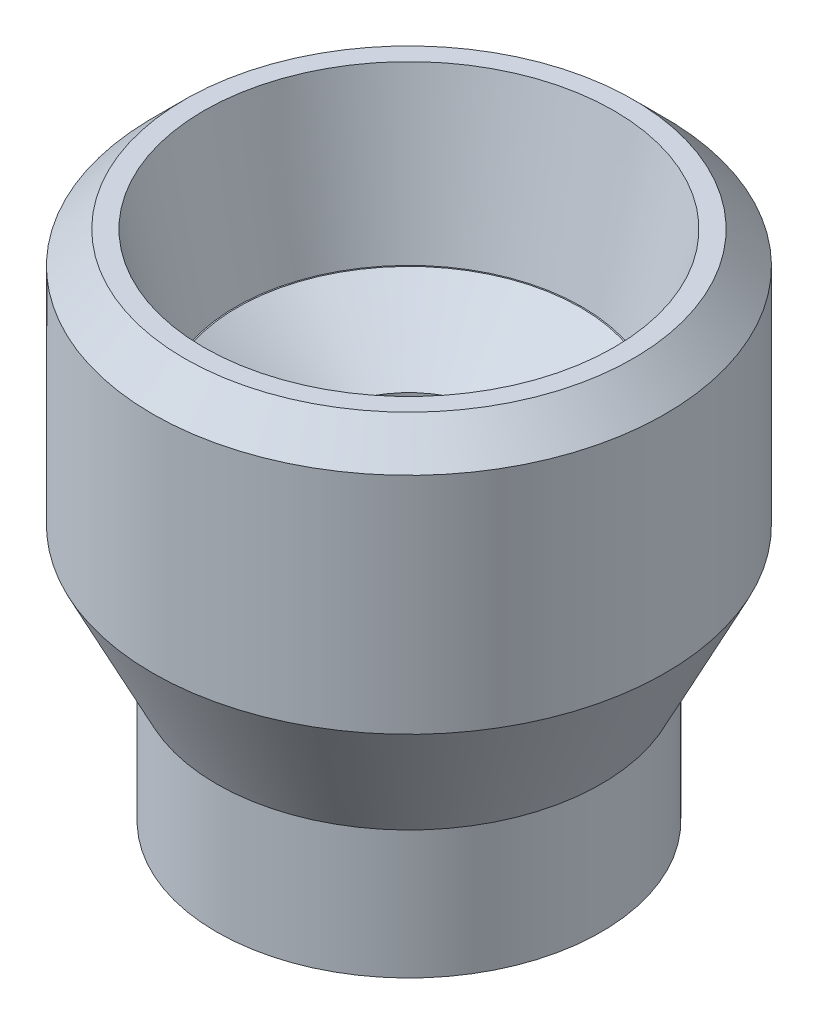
ISO-10303-21;
HEADER;
FILE_DESCRIPTION(('STEP AP214'),'2;1');
FILE_NAME('part.step','',(''),(''),'','','');
FILE_SCHEMA(('AUTOMOTIVE_DESIGN { 1 0 10303 214 1 1 1 1 }'));
ENDSEC;
DATA;
#1=APPLICATION_CONTEXT('core data for automotive mechanical design processes');
#2=APPLICATION_PROTOCOL_DEFINITION('international standard','automotive_design',2000,#1);
#3=PRODUCT_CONTEXT('',#1,'mechanical');
#4=PRODUCT('Part','Part','',(#3));
#5=PRODUCT_RELATED_PRODUCT_CATEGORY('part','',(#4));
#6=PRODUCT_DEFINITION_FORMATION('','',#4);
#7=PRODUCT_DEFINITION_CONTEXT('part definition',#1,'design');
#8=PRODUCT_DEFINITION('design','',#6,#7);
#9=PRODUCT_DEFINITION_SHAPE('','',#8);
#10=(LENGTH_UNIT() NAMED_UNIT(*) SI_UNIT(.MILLI.,.METRE.));
#11=(NAMED_UNIT(*) PLANE_ANGLE_UNIT() SI_UNIT($,.RADIAN.));
#12=(NAMED_UNIT(*) SI_UNIT($,.STERADIAN.) SOLID_ANGLE_UNIT());
#13=UNCERTAINTY_MEASURE_WITH_UNIT(LENGTH_MEASURE(1.E-05),#10,'distance_accuracy_value','');
#14=(GEOMETRIC_REPRESENTATION_CONTEXT(3) GLOBAL_UNCERTAINTY_ASSIGNED_CONTEXT((#13)) GLOBAL_UNIT_ASSIGNED_CONTEXT((#10,
#11,#12)) REPRESENTATION_CONTEXT('',''));
#15=CARTESIAN_POINT('',(0.,0.,0.));
#16=DIRECTION('',(0.,0.,1.));
#17=DIRECTION('',(1.,0.,0.));
#18=AXIS2_PLACEMENT_3D('',#15,#16,#17);
#19=CARTESIAN_POINT('',(0.,20.,0.));
#20=DIRECTION('',(0.,-1.,0.));
#21=DIRECTION('',(0.,0.,-1.));
#22=AXIS2_PLACEMENT_3D('',#19,#20,#21);
#23=CYLINDRICAL_SURFACE('',#22,3.5);
#24=CARTESIAN_POINT('',(0.,12.,0.));
#25=DIRECTION('',(0.,1.,0.));
#26=DIRECTION('',(0.,0.,1.));
#27=AXIS2_PLACEMENT_3D('',#24,#25,#26);
#28=CIRCLE('',#27,3.5);
#29=CARTESIAN_POINT('',(0.,12.,3.5));
#30=VERTEX_POINT('',#29);
#31=EDGE_CURVE('E46',#30,#30,#28,.T.);
#32=ORIENTED_EDGE('',*,*,#31,.T.);
#33=EDGE_LOOP('',(#32));
#34=FACE_BOUND('',#33,.T.);
#35=CARTESIAN_POINT('',(0.,0.,0.));
#36=DIRECTION('',(0.,-1.,0.));
#37=DIRECTION('',(0.,0.,-1.));
#38=AXIS2_PLACEMENT_3D('',#35,#36,#37);
#39=CIRCLE('',#38,3.5);
#40=CARTESIAN_POINT('',(0.,0.,-3.5));
#41=VERTEX_POINT('',#40);
#42=EDGE_CURVE('E67',#41,#41,#39,.T.);
#43=ORIENTED_EDGE('',*,*,#42,.T.);
#44=EDGE_LOOP('',(#43));
#45=FACE_BOUND('',#44,.T.);
#46=ADVANCED_FACE('F35',(#34,#45),#23,.F.);
#47=CARTESIAN_POINT('',(0.,10.,0.));
#48=DIRECTION('',(0.,-1.,0.));
#49=DIRECTION('',(0.,0.,-1.));
#50=AXIS2_PLACEMENT_3D('',#47,#48,#49);
#51=CYLINDRICAL_SURFACE('',#50,7.5);
#52=CARTESIAN_POINT('',(0.,5.00000000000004,0.));
#53=DIRECTION('',(0.,1.,0.));
#54=DIRECTION('',(0.,0.,1.));
#55=AXIS2_PLACEMENT_3D('',#52,#53,#54);
#56=CIRCLE('',#55,7.5);
#57=CARTESIAN_POINT('',(0.,5.00000000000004,7.5));
#58=VERTEX_POINT('',#57);
#59=EDGE_CURVE('E58',#58,#58,#56,.F.);
#60=ORIENTED_EDGE('',*,*,#59,.T.);
#61=EDGE_LOOP('',(#60));
#62=FACE_BOUND('',#61,.T.);
#63=CARTESIAN_POINT('',(0.,0.,0.));
#64=DIRECTION('',(0.,1.,0.));
#65=DIRECTION('',(0.,0.,1.));
#66=AXIS2_PLACEMENT_3D('',#63,#64,#65);
#67=CIRCLE('',#66,7.5);
#68=CARTESIAN_POINT('',(0.,0.,7.5));
#69=VERTEX_POINT('',#68);
#70=EDGE_CURVE('E61',#69,#69,#67,.T.);
#71=ORIENTED_EDGE('',*,*,#70,.T.);
#72=EDGE_LOOP('',(#71));
#73=FACE_BOUND('',#72,.T.);
#74=ADVANCED_FACE('F93',(#62,#73),#51,.T.);
#75=CARTESIAN_POINT('',(0.,0.,0.));
#76=DIRECTION('',(0.,1.,0.));
#77=DIRECTION('',(0.,0.,1.));
#78=AXIS2_PLACEMENT_3D('',#75,#76,#77);
#79=PLANE('',#78);
#80=ORIENTED_EDGE('',*,*,#42,.F.);
#81=EDGE_LOOP('',(#80));
#82=FACE_BOUND('',#81,.T.);
#83=ORIENTED_EDGE('',*,*,#70,.F.);
#84=EDGE_LOOP('',(#83));
#85=FACE_BOUND('',#84,.T.);
#86=ADVANCED_FACE('F89',(#82,#85),#79,.F.);
#87=CARTESIAN_POINT('',(0.,20.,0.));
#88=DIRECTION('',(0.,-1.,0.));
#89=DIRECTION('',(0.,0.,-1.));
#90=AXIS2_PLACEMENT_3D('',#87,#88,#89);
#91=CYLINDRICAL_SURFACE('',#90,10.);
#92=CARTESIAN_POINT('',(0.,18.75,0.));
#93=DIRECTION('',(0.,1.,0.));
#94=DIRECTION('',(0.,0.,1.));
#95=AXIS2_PLACEMENT_3D('',#92,#93,#94);
#96=CIRCLE('',#95,10.);
#97=CARTESIAN_POINT('',(0.,18.75,10.));
#98=VERTEX_POINT('',#97);
#99=EDGE_CURVE('E10',#98,#98,#96,.F.);
#100=ORIENTED_EDGE('',*,*,#99,.T.);
#101=EDGE_LOOP('',(#100));
#102=FACE_BOUND('',#101,.T.);
#103=CARTESIAN_POINT('',(0.,10.,0.));
#104=DIRECTION('',(0.,1.,0.));
#105=DIRECTION('',(0.,0.,1.));
#106=AXIS2_PLACEMENT_3D('',#103,#104,#105);
#107=CIRCLE('',#106,10.);
#108=CARTESIAN_POINT('',(0.,10.,10.));
#109=VERTEX_POINT('',#108);
#110=EDGE_CURVE('E64',#109,#109,#107,.T.);
#111=ORIENTED_EDGE('',*,*,#110,.T.);
#112=EDGE_LOOP('',(#111));
#113=FACE_BOUND('',#112,.T.);
#114=ADVANCED_FACE('F80',(#102,#113),#91,.T.);
#115=CARTESIAN_POINT('',(0.,20.,0.));
#116=DIRECTION('',(0.,1.,0.));
#117=DIRECTION('',(0.,0.,1.));
#118=AXIS2_PLACEMENT_3D('',#115,#116,#117);
#119=PLANE('',#118);
#120=CARTESIAN_POINT('',(0.,20.,0.));
#121=DIRECTION('',(0.,1.,0.));
#122=DIRECTION('',(0.,0.,1.));
#123=AXIS2_PLACEMENT_3D('',#120,#121,#122);
#124=CIRCLE('',#123,8.75);
#125=CARTESIAN_POINT('',(0.,20.,8.75));
#126=VERTEX_POINT('',#125);
#127=EDGE_CURVE('E42',#126,#126,#124,.T.);
#128=ORIENTED_EDGE('',*,*,#127,.T.);
#129=EDGE_LOOP('',(#128));
#130=FACE_BOUND('',#129,.T.);
#131=CARTESIAN_POINT('',(0.,20.,0.));
#132=DIRECTION('',(0.,1.,0.));
#133=DIRECTION('',(0.,0.,1.));
#134=AXIS2_PLACEMENT_3D('',#131,#132,#133);
#135=CIRCLE('',#134,8.);
#136=CARTESIAN_POINT('',(0.,20.,8.00000000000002));
#137=VERTEX_POINT('',#136);
#138=EDGE_CURVE('E70',#137,#137,#135,.T.);
#139=ORIENTED_EDGE('',*,*,#138,.F.);
#140=EDGE_LOOP('',(#139));
#141=FACE_BOUND('',#140,.T.);
#142=ADVANCED_FACE('F77',(#130,#141),#119,.T.);
#143=CARTESIAN_POINT('',(0.,10.,0.));
#144=DIRECTION('',(0.,1.,0.));
#145=DIRECTION('',(0.,0.,1.));
#146=AXIS2_PLACEMENT_3D('',#143,#144,#145);
#147=CONICAL_SURFACE('',#146,9.99999999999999,0.463647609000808);
#148=ORIENTED_EDGE('',*,*,#59,.F.);
#149=EDGE_LOOP('',(#148));
#150=FACE_BOUND('',#149,.T.);
#151=ORIENTED_EDGE('',*,*,#110,.F.);
#152=EDGE_LOOP('',(#151));
#153=FACE_BOUND('',#152,.T.);
#154=ADVANCED_FACE('F79',(#150,#153),#147,.T.);
#155=CARTESIAN_POINT('',(0.,14.,0.));
#156=DIRECTION('',(0.,1.,0.));
#157=DIRECTION('',(0.,0.,1.));
#158=AXIS2_PLACEMENT_3D('',#155,#156,#157);
#159=PLANE('',#158);
#160=CARTESIAN_POINT('',(0.,14.,0.));
#161=DIRECTION('',(0.,1.,0.));
#162=DIRECTION('',(0.,0.,1.));
#163=AXIS2_PLACEMENT_3D('',#160,#161,#162);
#164=CIRCLE('',#163,6.7006690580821);
#165=CARTESIAN_POINT('',(0.,14.,6.7006690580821));
#166=VERTEX_POINT('',#165);
#167=EDGE_CURVE('E50',#166,#166,#164,.F.);
#168=ORIENTED_EDGE('',*,*,#167,.T.);
#169=EDGE_LOOP('',(#168));
#170=FACE_BOUND('',#169,.T.);
#171=CARTESIAN_POINT('',(0.,14.,0.));
#172=DIRECTION('',(0.,1.,0.));
#173=DIRECTION('',(0.,0.,1.));
#174=AXIS2_PLACEMENT_3D('',#171,#172,#173);
#175=CIRCLE('',#174,6.74999999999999);
#176=CARTESIAN_POINT('',(0.,14.,6.74999999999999));
#177=VERTEX_POINT('',#176);
#178=EDGE_CURVE('E55',#177,#177,#175,.T.);
#179=ORIENTED_EDGE('',*,*,#178,.T.);
#180=EDGE_LOOP('',(#179));
#181=FACE_BOUND('',#180,.T.);
#182=ADVANCED_FACE('F86',(#170,#181),#159,.T.);
#183=CARTESIAN_POINT('',(0.,14.,0.));
#184=DIRECTION('',(0.,1.,0.));
#185=DIRECTION('',(0.,0.,1.));
#186=AXIS2_PLACEMENT_3D('',#183,#184,#185);
#187=CONICAL_SURFACE('',#186,6.74999999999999,0.205395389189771);
#188=CARTESIAN_POINT('',(0.,20.,8.00000000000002));
#189=CARTESIAN_POINT('',(0.,19.9375,7.98697916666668));
#190=CARTESIAN_POINT('',(0.,19.875,7.97395833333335));
#191=CARTESIAN_POINT('',(0.,19.75,7.94791666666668));
#192=CARTESIAN_POINT('',(0.,19.6875,7.93489583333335));
#193=CARTESIAN_POINT('',(0.,19.5625,7.90885416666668));
#194=CARTESIAN_POINT('',(0.,19.5,7.89583333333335));
#195=CARTESIAN_POINT('',(0.,19.375,7.86979166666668));
#196=CARTESIAN_POINT('',(0.,19.3125,7.85677083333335));
#197=CARTESIAN_POINT('',(0.,19.1875,7.83072916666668));
#198=CARTESIAN_POINT('',(0.,19.125,7.81770833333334));
#199=CARTESIAN_POINT('',(0.,19.,7.79166666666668));
#200=CARTESIAN_POINT('',(0.,18.9375,7.77864583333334));
#201=CARTESIAN_POINT('',(0.,18.8125,7.75260416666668));
#202=CARTESIAN_POINT('',(0.,18.75,7.73958333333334));
#203=CARTESIAN_POINT('',(0.,18.625,7.71354166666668));
#204=CARTESIAN_POINT('',(0.,18.5625,7.70052083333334));
#205=CARTESIAN_POINT('',(0.,18.4375,7.67447916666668));
#206=CARTESIAN_POINT('',(0.,18.375,7.66145833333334));
#207=CARTESIAN_POINT('',(0.,18.25,7.63541666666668));
#208=CARTESIAN_POINT('',(0.,18.1875,7.62239583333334));
#209=CARTESIAN_POINT('',(0.,18.0625,7.59635416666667));
#210=CARTESIAN_POINT('',(0.,18.,7.58333333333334));
#211=CARTESIAN_POINT('',(0.,17.875,7.55729166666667));
#212=CARTESIAN_POINT('',(0.,17.8125,7.54427083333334));
#213=CARTESIAN_POINT('',(0.,17.6875,7.51822916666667));
#214=CARTESIAN_POINT('',(0.,17.625,7.50520833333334));
#215=CARTESIAN_POINT('',(0.,17.5,7.47916666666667));
#216=CARTESIAN_POINT('',(0.,17.4375,7.46614583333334));
#217=CARTESIAN_POINT('',(0.,17.3125,7.44010416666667));
#218=CARTESIAN_POINT('',(0.,17.25,7.42708333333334));
#219=CARTESIAN_POINT('',(0.,17.125,7.40104166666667));
#220=CARTESIAN_POINT('',(0.,17.0625,7.38802083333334));
#221=CARTESIAN_POINT('',(0.,16.9375,7.36197916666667));
#222=CARTESIAN_POINT('',(0.,16.875,7.34895833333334));
#223=CARTESIAN_POINT('',(0.,16.75,7.32291666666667));
#224=CARTESIAN_POINT('',(0.,16.6875,7.30989583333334));
#225=CARTESIAN_POINT('',(0.,16.5625,7.28385416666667));
#226=CARTESIAN_POINT('',(0.,16.5,7.27083333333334));
#227=CARTESIAN_POINT('',(0.,16.375,7.24479166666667));
#228=CARTESIAN_POINT('',(0.,16.3125,7.23177083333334));
#229=CARTESIAN_POINT('',(0.,16.1875,7.20572916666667));
#230=CARTESIAN_POINT('',(0.,16.125,7.19270833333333));
#231=CARTESIAN_POINT('',(0.,16.,7.16666666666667));
#232=CARTESIAN_POINT('',(0.,15.9375,7.15364583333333));
#233=CARTESIAN_POINT('',(0.,15.8125,7.12760416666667));
#234=CARTESIAN_POINT('',(0.,15.75,7.11458333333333));
#235=CARTESIAN_POINT('',(0.,15.625,7.08854166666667));
#236=CARTESIAN_POINT('',(0.,15.5625,7.07552083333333));
#237=CARTESIAN_POINT('',(0.,15.4375,7.04947916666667));
#238=CARTESIAN_POINT('',(0.,15.375,7.03645833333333));
#239=CARTESIAN_POINT('',(0.,15.25,7.01041666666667));
#240=CARTESIAN_POINT('',(0.,15.1875,6.99739583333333));
#241=CARTESIAN_POINT('',(0.,15.0625,6.97135416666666));
#242=CARTESIAN_POINT('',(0.,15.,6.95833333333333));
#243=CARTESIAN_POINT('',(0.,14.875,6.93229166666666));
#244=CARTESIAN_POINT('',(0.,14.8125,6.91927083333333));
#245=CARTESIAN_POINT('',(0.,14.6875,6.89322916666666));
#246=CARTESIAN_POINT('',(0.,14.625,6.88020833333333));
#247=CARTESIAN_POINT('',(0.,14.5,6.85416666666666));
#248=CARTESIAN_POINT('',(0.,14.4375,6.84114583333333));
#249=CARTESIAN_POINT('',(0.,14.3125,6.81510416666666));
#250=CARTESIAN_POINT('',(0.,14.25,6.80208333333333));
#251=CARTESIAN_POINT('',(0.,14.125,6.77604166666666));
#252=CARTESIAN_POINT('',(0.,14.0625,6.76302083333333));
#253=CARTESIAN_POINT('',(0.,14.,6.74999999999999));
#254=B_SPLINE_CURVE_WITH_KNOTS('',3,(#188,#189,#190,#191,#192,#193,#194,#195,#196,#197,#198,
#199,#200,#201,#202,#203,#204,#205,#206,#207,#208,#209,#210,#211,#212,#213,#214,#215,#216,#217,
#218,#219,#220,#221,#222,#223,#224,#225,#226,#227,#228,#229,#230,#231,#232,#233,#234,#235,#236,
#237,#238,#239,#240,#241,#242,#243,#244,#245,#246,#247,#248,#249,#250,#251,#252,#253),
.UNSPECIFIED.,.F.,.F.,(4,2,2,2,2,2,2,2,2,2,2,2,2,2,2,2,2,2,2,2,2,2,2,2,2,2,2,2,2,2,2,2,4),(0.,
0.191525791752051,0.383051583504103,0.574577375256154,0.766103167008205,0.957628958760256,
1.14915475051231,1.34068054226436,1.53220633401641,1.72373212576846,1.91525791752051,
2.10678370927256,2.29830950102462,2.48983529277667,2.68136108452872,2.87288687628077,
3.06441266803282,3.25593845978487,3.44746425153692,3.63899004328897,3.83051583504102,
4.02204162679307,4.21356741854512,4.40509321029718,4.59661900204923,4.78814479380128,
4.97967058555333,5.17119637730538,5.36272216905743,5.55424796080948,5.74577375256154,
5.93729954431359,6.12882533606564),.UNSPECIFIED.);
#255=EDGE_CURVE('BSEAM74',#137,#177,#254,.T.);
#256=ORIENTED_EDGE('',*,*,#138,.T.);
#257=ORIENTED_EDGE('',*,*,#178,.F.);
#258=ORIENTED_EDGE('',*,*,#255,.T.);
#259=ORIENTED_EDGE('',*,*,#255,.F.);
#260=EDGE_LOOP('',(#256,#258,#257,#259));
#261=FACE_BOUND('',#260,.T.);
#262=ADVANCED_FACE('F74',(#261),#187,.F.);
#263=CARTESIAN_POINT('',(0.,14.,0.));
#264=DIRECTION('',(0.,1.,0.));
#265=DIRECTION('',(0.,0.,1.));
#266=AXIS2_PLACEMENT_3D('',#263,#264,#265);
#267=CONICAL_SURFACE('',#266,6.7006690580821,1.01229096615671);
#268=ORIENTED_EDGE('',*,*,#31,.F.);
#269=EDGE_LOOP('',(#268));
#270=FACE_BOUND('',#269,.T.);
#271=ORIENTED_EDGE('',*,*,#167,.F.);
#272=EDGE_LOOP('',(#271));
#273=FACE_BOUND('',#272,.T.);
#274=ADVANCED_FACE('F107',(#270,#273),#267,.F.);
#275=CARTESIAN_POINT('',(0.,20.,0.));
#276=DIRECTION('',(0.,-1.,0.));
#277=DIRECTION('',(0.,0.,-1.));
#278=AXIS2_PLACEMENT_3D('',#275,#276,#277);
#279=CONICAL_SURFACE('',#278,8.75,0.785398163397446);
#280=ORIENTED_EDGE('',*,*,#99,.F.);
#281=EDGE_LOOP('',(#280));
#282=FACE_BOUND('',#281,.T.);
#283=ORIENTED_EDGE('',*,*,#127,.F.);
#284=EDGE_LOOP('',(#283));
#285=FACE_BOUND('',#284,.T.);
#286=ADVANCED_FACE('F37',(#282,#285),#279,.T.);
#287=CLOSED_SHELL('',(#46,#74,#86,#114,#142,#154,#182,#262,#274,#286));
#288=MANIFOLD_SOLID_BREP('B2',#287);
#289=ADVANCED_BREP_SHAPE_REPRESENTATION('',(#18,#288),#14);
#290=SHAPE_DEFINITION_REPRESENTATION(#9,#289);
ENDSEC;
END-ISO-10303-21;
